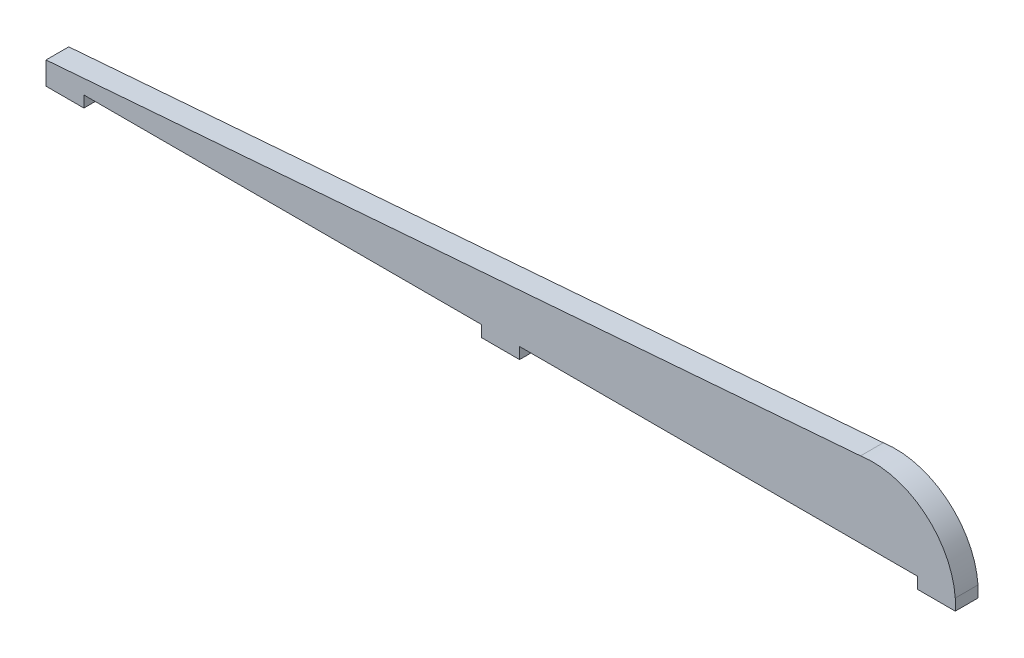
from build123d import *

# Parameters (mm, degrees)
BOSS_EXTRUDE2_DEPTH = 6


with BuildPart() as part:
    # Sketch1 → Boss-Extrude2 (new body)
    with BuildSketch(Plane.XY):
        with BuildLine():
            Line((120, 0), (120, -3))
            Line((120, -3), (110, -3))
            Line((110, -3), (110, 0))
            Line((110, 0), (5, 0))
            Line((5, 0), (5, -3))
            Line((5, -3), (-5, -3))
            Line((-5, -3), (-5, 0))
            Line((-5, 0), (-110, 0))
            Line((-110, 0), (-110, -3))
            Line((-110, -3), (-120, -3))
            Line((-120, -3), (-120, 0))
            Line((-120, 0), (-120, 3))
            Line((-120, 3), (95, 20))
            ThreePointArc((95, 20), (111.850986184, 15.43873273), (120, 0))
        make_face()
    extrude(amount=BOSS_EXTRUDE2_DEPTH)


solid = part.part
